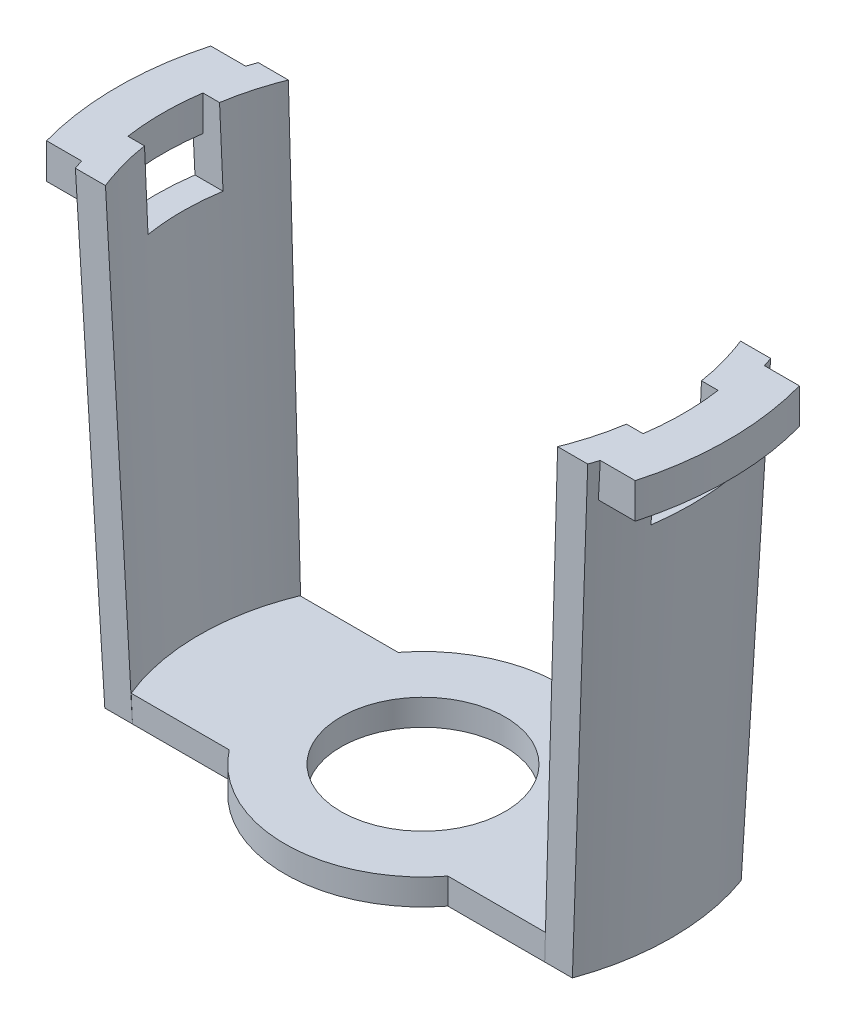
from build123d import *

# Parameters (mm, degrees)
SKETCH1_R                 = 4.445
BASE_DEPTH                = 1.4097
RADIAL_FLANGE_DEPTH       = 1.905
AXIAL_CUT_OUT_DEPTH       = 4.064
RADIAL_CUT_OUT_DEPTH      = 31.822696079
RADIAL_CUT_OUT_DEPTH_BACK = 31.822696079
SKETCH6_W                 = 4.064
SKETCH6_H                 = 2.159


with BuildPart() as part:
    # Sketch1 → Base (new body)
    with BuildSketch(Plane(origin=(0, 0, 0), x_dir=(1, 0, 0), z_dir=(0, 1, 0))):
        with BuildLine():
            Line((-12.661842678, 4.572), (-5.920447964, 4.572))
            ThreePointArc((-5.920447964, 4.572), (0, 7.4803), (5.920447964, 4.572))
            Line((5.920447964, 4.572), (12.661842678, 4.572))
            ThreePointArc((12.661842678, 4.572), (13.462, 0), (12.661842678, -4.572))
            Line((12.661842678, -4.572), (5.920447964, -4.572))
            ThreePointArc((5.920447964, -4.572), (0, -7.4803), (-5.920447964, -4.572))
            Line((-5.920447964, -4.572), (-12.661842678, -4.572))
            ThreePointArc((-12.661842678, -4.572), (-13.462, 0), (-12.661842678, 4.572))
        make_face()
        with Locations(Location((0, 0, 0), (0, 0, 270))):
            Circle(SKETCH1_R, mode=Mode.SUBTRACT)
    extrude(amount=BASE_DEPTH)

    # Sketch3 for Arm loft → Arm loft section 0
    with BuildSketch(Plane(origin=(0, 0, 0), x_dir=(1, 0, 0), z_dir=(0, 1, 0))):
        with BuildLine():
            Line((-12.661842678, -4.572), (-11.163242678, -4.572))
            # circular arc as an exact rational Bezier (weights 1, cos(half-angle), 1)
            Bezier((-11.163242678, -4.572), (-13.035743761, 0), (-11.163242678, 4.572), weights=[1, 0.92539527, 1])
            Line((-11.163242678, 4.572), (-12.661842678, 4.572))
            Bezier((-12.661842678, 4.572), (-14.31272277, 0), (-12.661842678, -4.572), weights=[1, 0.94056178, 1])
        make_face()
    # Sketch2 for Arm loft → Arm loft section 1
    with BuildSketch(Plane(origin=(0, 24.9047, 0), x_dir=(-1, 0, 0), z_dir=(0, -1, 0))):
        with BuildLine():
            Line((12.244143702, 4.953), (13.874423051, 4.953))
            Bezier((13.874423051, 4.953), (15.64258371, 0), (13.874423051, -4.953), weights=[1, 0.941788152, 1])
            Line((13.874423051, -4.953), (12.244143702, -4.953))
            Bezier((12.244143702, -4.953), (14.247730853, 0), (12.244143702, 4.953), weights=[1, 0.927024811, 1])
        make_face()
    arm_loft = loft()

    # Mirror of arm loft: Arm loft across plane
    add(arm_loft.mirror(Plane(origin=(0, 0, 0), x_dir=(0, 0, 1), z_dir=(1, 0, 0))))

    # Sketch4 → Radial flange (add)
    with BuildSketch(Plane(origin=(0, 24.9047, 0), x_dir=(-1, 0, 0), z_dir=(0, -1, 0))):
        with BuildLine():
            Line((12.437573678, 4.445), (15.939936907, 4.445))
            ThreePointArc((15.939936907, 4.445), (16.5481, 0), (15.939936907, -4.445))
            Line((15.939936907, -4.445), (12.437573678, -4.445))
            ThreePointArc((12.437573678, -4.445), (13.208, 0), (12.437573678, 4.445))
        make_face()
    radial_flange = extrude(amount=RADIAL_FLANGE_DEPTH)

    # Sketch5 → Axial cut-out (cut)
    with BuildSketch(Plane(origin=(0, 24.9047, 0), x_dir=(1, 0, 0), z_dir=(0, 1, 0))):
        with BuildLine():
            Line((-11.247927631, 2.032), (-13.949780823, 2.032))
            ThreePointArc((-13.949780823, 2.032), (-14.097, 0), (-13.949780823, -2.032))
            Line((-13.949780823, -2.032), (-11.247927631, -2.032))
            ThreePointArc((-11.247927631, -2.032), (-11.43, 0), (-11.247927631, 2.032))
        make_face()
    axial_cut_out = extrude(amount=-AXIAL_CUT_OUT_DEPTH, mode=Mode.SUBTRACT)

    # Mirror of radial flange and axial cut-ou: Radial flange, Axial cut-out across plane
    add(radial_flange.mirror(Plane(origin=(0, 0, 0), x_dir=(0, 0, 1), z_dir=(1, 0, 0))))
    add(axial_cut_out.mirror(Plane(origin=(0, 0, 0), x_dir=(0, 0, 1), z_dir=(1, 0, 0))), mode=Mode.SUBTRACT)

    # Sketch6 → Radial cut-out (cut, two sides: drawn at the far end of the back side and taken through both)
    with BuildSketch(Plane(origin=(0, 0, 0), x_dir=(0, 0, -1), z_dir=(1, 0, 0)).offset(-RADIAL_CUT_OUT_DEPTH_BACK)):
        with Locations((0, 21.9202)):
            Rectangle(SKETCH6_W, SKETCH6_H)
    extrude(amount=RADIAL_CUT_OUT_DEPTH + RADIAL_CUT_OUT_DEPTH_BACK, mode=Mode.SUBTRACT)


solid = part.part
